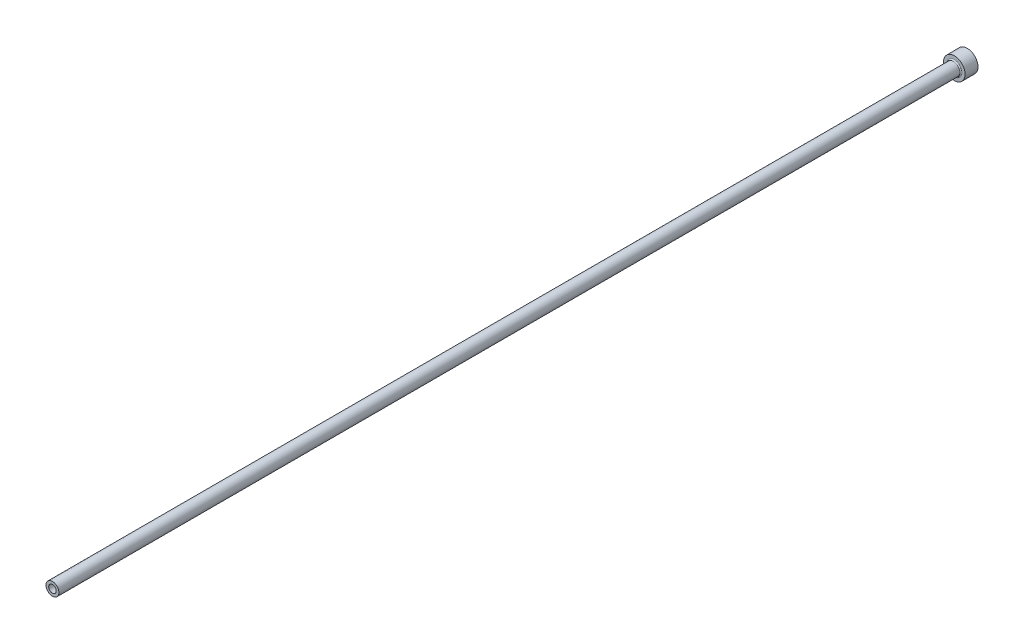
from build123d import *

# Parameters (mm, degrees)
HEAD_FILLET_R          = 0.5
ID_RELIEF_CHAMFER_SIZE = 0.5


with BuildPart() as part:
    # OD FV → Base Revolve (revolve)
    with BuildSketch(Plane(origin=(0, 0, 0), x_dir=(1, 0, 0), z_dir=(0, 1, 0))):
        Polygon((0, -425), (3, -425), (3, -6), (5, -6), (5, 0), (0, 0), align=None)
    revolve(axis=Axis((0, 0, 425), (0, 0, -1)))

    # ID FV → Hole (revolve, cut)
    with BuildSketch(Plane(origin=(0, 0, 0), x_dir=(1, 0, 0), z_dir=(0, 1, 0))):
        Polygon((0, -425), (1.75, -425), (1.75, -275), (2, -274.566987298), (2, 0), (0, 0), align=None)
    revolve(axis=Axis((0, 0, 425), (0, 0, -1)), mode=Mode.SUBTRACT)

    # Head Fillet
    head_fillet_edges = [part.edges().sort_by_distance(p)[0] for p in [
        (-3, 0, 6),
    ]]
    fillet(head_fillet_edges, radius=HEAD_FILLET_R)

    # ID Relief Chamfer
    id_relief_chamfer_edges = [part.edges().sort_by_distance(p)[0] for p in [
        (-2, 0, 0),
    ]]
    chamfer(id_relief_chamfer_edges, length=ID_RELIEF_CHAMFER_SIZE)


solid = part.part
